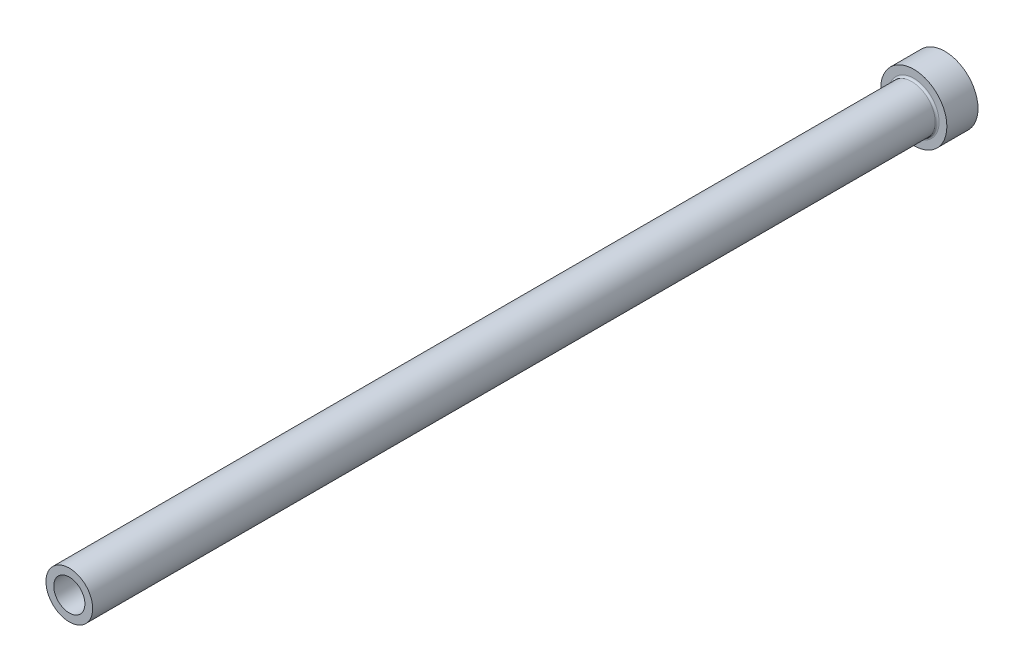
ISO-10303-21;
HEADER;
FILE_DESCRIPTION(('STEP AP214'),'2;1');
FILE_NAME('part.step','',(''),(''),'','','');
FILE_SCHEMA(('AUTOMOTIVE_DESIGN { 1 0 10303 214 1 1 1 1 }'));
ENDSEC;
DATA;
#1=APPLICATION_CONTEXT('core data for automotive mechanical design processes');
#2=APPLICATION_PROTOCOL_DEFINITION('international standard','automotive_design',2000,#1);
#3=PRODUCT_CONTEXT('',#1,'mechanical');
#4=PRODUCT('Part','Part','',(#3));
#5=PRODUCT_RELATED_PRODUCT_CATEGORY('part','',(#4));
#6=PRODUCT_DEFINITION_FORMATION('','',#4);
#7=PRODUCT_DEFINITION_CONTEXT('part definition',#1,'design');
#8=PRODUCT_DEFINITION('design','',#6,#7);
#9=PRODUCT_DEFINITION_SHAPE('','',#8);
#10=(LENGTH_UNIT() NAMED_UNIT(*) SI_UNIT(.MILLI.,.METRE.));
#11=(NAMED_UNIT(*) PLANE_ANGLE_UNIT() SI_UNIT($,.RADIAN.));
#12=(NAMED_UNIT(*) SI_UNIT($,.STERADIAN.) SOLID_ANGLE_UNIT());
#13=UNCERTAINTY_MEASURE_WITH_UNIT(LENGTH_MEASURE(1.E-05),#10,'distance_accuracy_value','');
#14=(GEOMETRIC_REPRESENTATION_CONTEXT(3) GLOBAL_UNCERTAINTY_ASSIGNED_CONTEXT((#13)) GLOBAL_UNIT_ASSIGNED_CONTEXT((#10,
#11,#12)) REPRESENTATION_CONTEXT('',''));
#15=CARTESIAN_POINT('',(0.,0.,0.));
#16=DIRECTION('',(0.,0.,1.));
#17=DIRECTION('',(1.,0.,0.));
#18=AXIS2_PLACEMENT_3D('',#15,#16,#17);
#19=CARTESIAN_POINT('',(0.,0.,225.));
#20=DIRECTION('',(0.,0.,-1.));
#21=DIRECTION('',(-1.,0.,0.));
#22=AXIS2_PLACEMENT_3D('',#19,#20,#21);
#23=PLANE('',#22);
#24=CARTESIAN_POINT('',(0.,0.,225.));
#25=DIRECTION('',(0.,0.,1.));
#26=DIRECTION('',(1.,0.,0.));
#27=AXIS2_PLACEMENT_3D('',#24,#25,#26);
#28=CIRCLE('',#27,3.99999999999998);
#29=CARTESIAN_POINT('',(3.99999999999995,0.,225.));
#30=VERTEX_POINT('',#29);
#31=EDGE_CURVE('E63',#30,#30,#28,.T.);
#32=ORIENTED_EDGE('',*,*,#31,.F.);
#33=EDGE_LOOP('',(#32));
#34=FACE_BOUND('',#33,.T.);
#35=CARTESIAN_POINT('',(0.,0.,225.));
#36=DIRECTION('',(0.,0.,1.));
#37=DIRECTION('',(1.,0.,0.));
#38=AXIS2_PLACEMENT_3D('',#35,#36,#37);
#39=CIRCLE('',#38,5.99999999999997);
#40=CARTESIAN_POINT('',(5.99999999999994,0.,225.));
#41=VERTEX_POINT('',#40);
#42=EDGE_CURVE('E54',#41,#41,#39,.T.);
#43=ORIENTED_EDGE('',*,*,#42,.T.);
#44=EDGE_LOOP('',(#43));
#45=FACE_BOUND('',#44,.T.);
#46=ADVANCED_FACE('F34',(#34,#45),#23,.F.);
#47=CARTESIAN_POINT('',(0.,0.,225.));
#48=DIRECTION('',(0.,0.,1.));
#49=DIRECTION('',(1.,0.,0.));
#50=AXIS2_PLACEMENT_3D('',#47,#48,#49);
#51=CYLINDRICAL_SURFACE('',#50,5.99999999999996);
#52=CARTESIAN_POINT('',(0.,0.,8.50000000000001));
#53=DIRECTION('',(0.,0.,1.));
#54=DIRECTION('',(1.,0.,0.));
#55=AXIS2_PLACEMENT_3D('',#52,#53,#54);
#56=CIRCLE('',#55,5.99999999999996);
#57=CARTESIAN_POINT('',(5.99999999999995,0.,8.50000000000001));
#58=VERTEX_POINT('',#57);
#59=EDGE_CURVE('E49',#58,#58,#56,.T.);
#60=ORIENTED_EDGE('',*,*,#59,.T.);
#61=EDGE_LOOP('',(#60));
#62=FACE_BOUND('',#61,.T.);
#63=ORIENTED_EDGE('',*,*,#42,.F.);
#64=EDGE_LOOP('',(#63));
#65=FACE_BOUND('',#64,.T.);
#66=ADVANCED_FACE('F92',(#62,#65),#51,.T.);
#67=CARTESIAN_POINT('',(0.,0.,8.));
#68=DIRECTION('',(0.,0.,1.));
#69=DIRECTION('',(1.,0.,0.));
#70=AXIS2_PLACEMENT_3D('',#67,#68,#69);
#71=PLANE('',#70);
#72=CARTESIAN_POINT('',(0.,0.,8.));
#73=DIRECTION('',(0.,0.,1.));
#74=DIRECTION('',(1.,0.,0.));
#75=AXIS2_PLACEMENT_3D('',#72,#73,#74);
#76=CIRCLE('',#75,6.49999999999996);
#77=CARTESIAN_POINT('',(6.49999999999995,0.,8.));
#78=VERTEX_POINT('',#77);
#79=EDGE_CURVE('E45',#78,#78,#76,.F.);
#80=ORIENTED_EDGE('',*,*,#79,.T.);
#81=EDGE_LOOP('',(#80));
#82=FACE_BOUND('',#81,.T.);
#83=CARTESIAN_POINT('',(0.,0.,8.00000000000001));
#84=DIRECTION('',(0.,0.,1.));
#85=DIRECTION('',(1.,0.,0.));
#86=AXIS2_PLACEMENT_3D('',#83,#84,#85);
#87=CIRCLE('',#86,8.49999999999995);
#88=CARTESIAN_POINT('',(8.49999999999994,0.,8.00000000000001));
#89=VERTEX_POINT('',#88);
#90=EDGE_CURVE('E57',#89,#89,#87,.T.);
#91=ORIENTED_EDGE('',*,*,#90,.T.);
#92=EDGE_LOOP('',(#91));
#93=FACE_BOUND('',#92,.T.);
#94=ADVANCED_FACE('F98',(#82,#93),#71,.T.);
#95=CARTESIAN_POINT('',(0.,0.,225.));
#96=DIRECTION('',(0.,0.,1.));
#97=DIRECTION('',(1.,0.,0.));
#98=AXIS2_PLACEMENT_3D('',#95,#96,#97);
#99=CYLINDRICAL_SURFACE('',#98,8.49999999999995);
#100=ORIENTED_EDGE('',*,*,#90,.F.);
#101=EDGE_LOOP('',(#100));
#102=FACE_BOUND('',#101,.T.);
#103=CARTESIAN_POINT('',(0.,0.,0.));
#104=DIRECTION('',(0.,0.,1.));
#105=DIRECTION('',(1.,0.,0.));
#106=AXIS2_PLACEMENT_3D('',#103,#104,#105);
#107=CIRCLE('',#106,8.49999999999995);
#108=CARTESIAN_POINT('',(8.49999999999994,0.,0.));
#109=VERTEX_POINT('',#108);
#110=EDGE_CURVE('E60',#109,#109,#107,.T.);
#111=ORIENTED_EDGE('',*,*,#110,.T.);
#112=EDGE_LOOP('',(#111));
#113=FACE_BOUND('',#112,.T.);
#114=ADVANCED_FACE('F89',(#102,#113),#99,.T.);
#115=CARTESIAN_POINT('',(0.,0.,0.));
#116=DIRECTION('',(0.,0.,1.));
#117=DIRECTION('',(1.,0.,0.));
#118=AXIS2_PLACEMENT_3D('',#115,#116,#117);
#119=PLANE('',#118);
#120=CARTESIAN_POINT('',(0.,0.,0.));
#121=DIRECTION('',(0.,0.,1.));
#122=DIRECTION('',(1.,0.,0.));
#123=AXIS2_PLACEMENT_3D('',#120,#121,#122);
#124=CIRCLE('',#123,4.74999999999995);
#125=CARTESIAN_POINT('',(4.74999999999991,0.,0.));
#126=VERTEX_POINT('',#125);
#127=EDGE_CURVE('E41',#126,#126,#124,.T.);
#128=ORIENTED_EDGE('',*,*,#127,.T.);
#129=EDGE_LOOP('',(#128));
#130=FACE_BOUND('',#129,.T.);
#131=ORIENTED_EDGE('',*,*,#110,.F.);
#132=EDGE_LOOP('',(#131));
#133=FACE_BOUND('',#132,.T.);
#134=ADVANCED_FACE('F83',(#130,#133),#119,.F.);
#135=CARTESIAN_POINT('',(0.,0.,225.));
#136=DIRECTION('',(0.,0.,1.));
#137=DIRECTION('',(1.,0.,0.));
#138=AXIS2_PLACEMENT_3D('',#135,#136,#137);
#139=CYLINDRICAL_SURFACE('',#138,3.99999999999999);
#140=ORIENTED_EDGE('',*,*,#31,.T.);
#141=EDGE_LOOP('',(#140));
#142=FACE_BOUND('',#141,.T.);
#143=CARTESIAN_POINT('',(0.,0.,125.));
#144=DIRECTION('',(0.,0.,1.));
#145=DIRECTION('',(1.,0.,0.));
#146=AXIS2_PLACEMENT_3D('',#143,#144,#145);
#147=CIRCLE('',#146,3.99999999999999);
#148=CARTESIAN_POINT('',(3.99999999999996,0.,125.));
#149=VERTEX_POINT('',#148);
#150=EDGE_CURVE('E66',#149,#149,#147,.T.);
#151=ORIENTED_EDGE('',*,*,#150,.F.);
#152=EDGE_LOOP('',(#151));
#153=FACE_BOUND('',#152,.T.);
#154=ADVANCED_FACE('F78',(#142,#153),#139,.F.);
#155=CARTESIAN_POINT('',(0.,0.,125.));
#156=DIRECTION('',(0.,0.,-1.));
#157=DIRECTION('',(-1.,0.,0.));
#158=AXIS2_PLACEMENT_3D('',#155,#156,#157);
#159=CONICAL_SURFACE('',#158,3.99999999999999,0.523598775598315);
#160=CARTESIAN_POINT('',(0.,0.,124.566987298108));
#161=DIRECTION('',(0.,0.,1.));
#162=DIRECTION('',(1.,0.,0.));
#163=AXIS2_PLACEMENT_3D('',#160,#161,#162);
#164=CIRCLE('',#163,4.24999999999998);
#165=CARTESIAN_POINT('',(4.24999999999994,0.,124.566987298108));
#166=VERTEX_POINT('',#165);
#167=EDGE_CURVE('E69',#166,#166,#164,.T.);
#168=ORIENTED_EDGE('',*,*,#167,.F.);
#169=EDGE_LOOP('',(#168));
#170=FACE_BOUND('',#169,.T.);
#171=ORIENTED_EDGE('',*,*,#150,.T.);
#172=EDGE_LOOP('',(#171));
#173=FACE_BOUND('',#172,.T.);
#174=ADVANCED_FACE('F75',(#170,#173),#159,.F.);
#175=CARTESIAN_POINT('',(0.,0.,225.));
#176=DIRECTION('',(0.,0.,1.));
#177=DIRECTION('',(1.,0.,0.));
#178=AXIS2_PLACEMENT_3D('',#175,#176,#177);
#179=CYLINDRICAL_SURFACE('',#178,4.24999999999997);
#180=CARTESIAN_POINT('',(0.,0.,0.5));
#181=DIRECTION('',(0.,0.,1.));
#182=DIRECTION('',(1.,0.,0.));
#183=AXIS2_PLACEMENT_3D('',#180,#181,#182);
#184=CIRCLE('',#183,4.24999999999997);
#185=CARTESIAN_POINT('',(4.24999999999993,0.,0.5));
#186=VERTEX_POINT('',#185);
#187=EDGE_CURVE('E10',#186,#186,#184,.F.);
#188=ORIENTED_EDGE('',*,*,#187,.T.);
#189=EDGE_LOOP('',(#188));
#190=FACE_BOUND('',#189,.T.);
#191=ORIENTED_EDGE('',*,*,#167,.T.);
#192=EDGE_LOOP('',(#191));
#193=FACE_BOUND('',#192,.T.);
#194=ADVANCED_FACE('F73',(#190,#193),#179,.F.);
#195=CARTESIAN_POINT('',(0.,0.,8.50000000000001));
#196=DIRECTION('',(0.,0.,1.));
#197=DIRECTION('',(1.,0.,0.));
#198=AXIS2_PLACEMENT_3D('',#195,#196,#197);
#199=TOROIDAL_SURFACE('',#198,6.49999999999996,0.5);
#200=ORIENTED_EDGE('',*,*,#79,.F.);
#201=EDGE_LOOP('',(#200));
#202=FACE_BOUND('',#201,.T.);
#203=ORIENTED_EDGE('',*,*,#59,.F.);
#204=EDGE_LOOP('',(#203));
#205=FACE_BOUND('',#204,.T.);
#206=ADVANCED_FACE('F104',(#202,#205),#199,.F.);
#207=CARTESIAN_POINT('',(0.,0.,0.));
#208=DIRECTION('',(0.,0.,-1.));
#209=DIRECTION('',(-1.,0.,0.));
#210=AXIS2_PLACEMENT_3D('',#207,#208,#209);
#211=CONICAL_SURFACE('',#210,4.74999999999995,0.785398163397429);
#212=ORIENTED_EDGE('',*,*,#187,.F.);
#213=EDGE_LOOP('',(#212));
#214=FACE_BOUND('',#213,.T.);
#215=ORIENTED_EDGE('',*,*,#127,.F.);
#216=EDGE_LOOP('',(#215));
#217=FACE_BOUND('',#216,.T.);
#218=ADVANCED_FACE('F36',(#214,#217),#211,.F.);
#219=CLOSED_SHELL('',(#46,#66,#94,#114,#134,#154,#174,#194,#206,#218));
#220=MANIFOLD_SOLID_BREP('B2',#219);
#221=ADVANCED_BREP_SHAPE_REPRESENTATION('',(#18,#220),#14);
#222=SHAPE_DEFINITION_REPRESENTATION(#9,#221);
ENDSEC;
END-ISO-10303-21;
